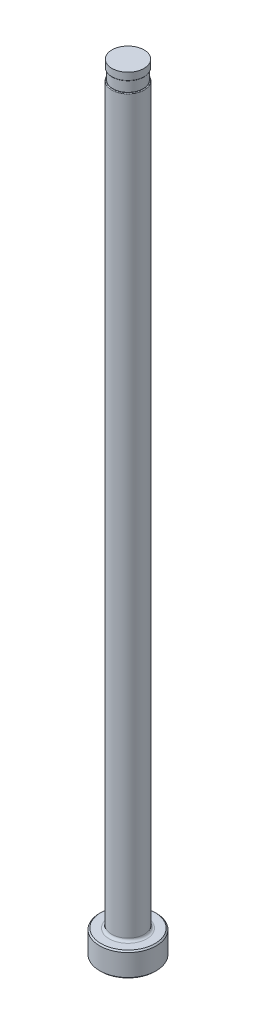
from build123d import *

# Parameters (mm, degrees)
CHAMFER1_SIZE     = 0.254
FILLET1_R         = 0.508
SKETCH2_W         = 0.2032
SKETCH2_H         = 2.032
D_SLOT_DEPTH      = 153.60197502
D_SLOT_DEPTH_BACK = 153.60197502
SKETCH5_W         = 0.0254
SKETCH5_H         = 1.524
FILLET2_R         = 0.127


with BuildPart() as part:
    # Sketch1 → Revolve1 (revolve)
    with BuildSketch(Plane.XY, mode=Mode.PRIVATE) as revolve1_sk:
        Polygon((0, 0), (-5.5499, 0), (-5.5499, 4.7498), (-3.175, 4.7498), (-3.175, 152.4), (0, 152.4), align=None)
    revolve(revolve1_sk.sketch.rotate(Axis((0, 259.958771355, 0), (0, -1, 0)), 270), axis=Axis((0, 259.958771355, 0), (0, -1, 0)))

    # Chamfer1
    chamfer1_edges = [part.edges().sort_by_distance(p)[0] for p in [
        (0, 4.7498, -5.5499),
        (0, 0, -5.5499),
    ]]
    chamfer(chamfer1_edges, length=CHAMFER1_SIZE)

    # Fillet1
    fillet1_edges = [part.edges().sort_by_distance(p)[0] for p in [
        (0, 4.7498, -3.175),
    ]]
    fillet(fillet1_edges, radius=FILLET1_R)

    # Sketch2 → Vent Relief (revolve, cut)
    with BuildSketch(Plane.XY, mode=Mode.PRIVATE) as vent_relief_sk:
        with Locations((-3.0734, 149.86)):
            Rectangle(SKETCH2_W, SKETCH2_H)
    revolve(vent_relief_sk.sketch.rotate(Axis((0, 153.448281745, 0), (0, -1, 0)), 270), axis=Axis((0, 153.448281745, 0), (0, -1, 0)), mode=Mode.SUBTRACT)

    # Sketch3 → D-Slot (cut, two sides: drawn at the far end of the back side and taken through both)
    with BuildSketch(Plane.XY.offset(-D_SLOT_DEPTH_BACK)):
        with BuildLine():
            Line((-2.9718, 149.86), (-2.9718, 86.36))
            ThreePointArc((-2.9718, 86.36), (-3.023013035, 85.792038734), (-3.175, 85.2424))
            Line((-3.175, 85.2424), (-3.175, 149.86))
            Line((-3.175, 149.86), (-2.9718, 149.86))
        make_face()
    extrude(amount=D_SLOT_DEPTH + D_SLOT_DEPTH_BACK, mode=Mode.SUBTRACT)

    # Sketch5 → Vent Diameter (revolve, cut)
    with BuildSketch(Plane.XY, mode=Mode.PRIVATE) as vent_diameter_sk:
        with Locations((-3.1623, 151.638)):
            Rectangle(SKETCH5_W, SKETCH5_H)
    revolve(vent_diameter_sk.sketch.rotate(Axis((0, 152.687735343, 0), (0, -1, 0)), 90), axis=Axis((0, 152.687735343, 0), (0, -1, 0)), mode=Mode.SUBTRACT)

    # Fillet2
    fillet2_edges = [part.edges().sort_by_distance(p)[0] for p in [
        (2.610460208, 148.844, -1.807241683),
        (0, 150.876, 3.1496),
    ]]
    fillet(fillet2_edges, radius=FILLET2_R)


solid = part.part
